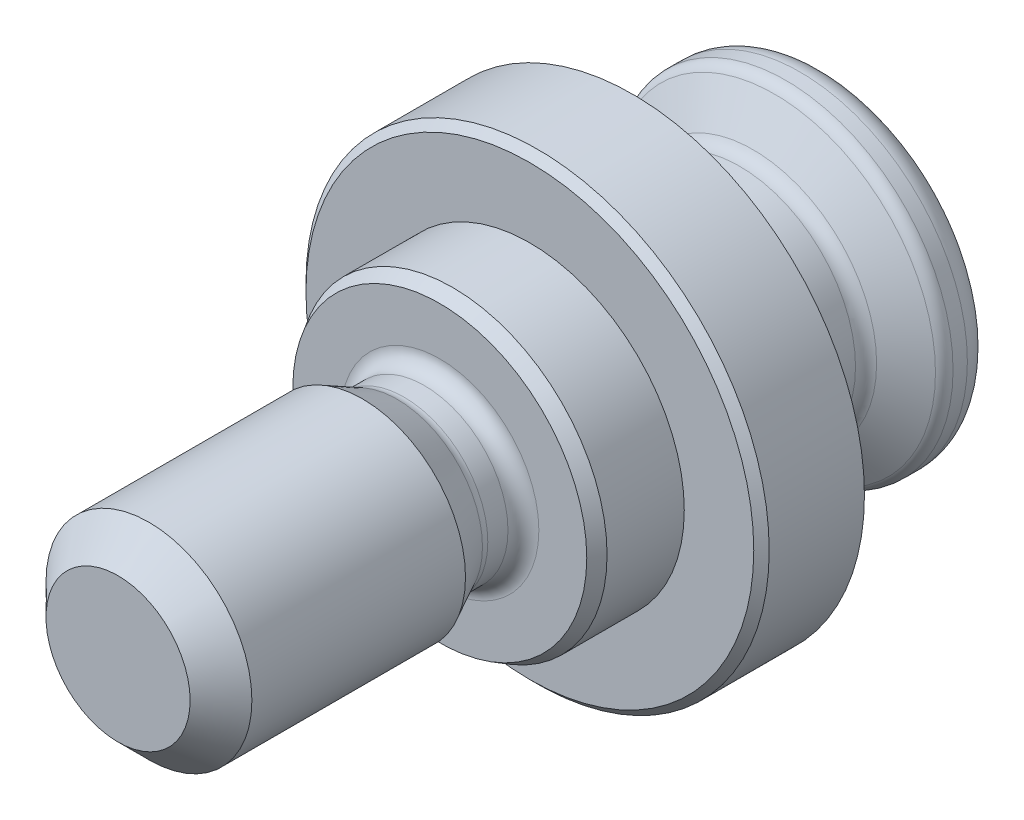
ISO-10303-21;
HEADER;
FILE_DESCRIPTION(('STEP AP214'),'2;1');
FILE_NAME('part.step','',(''),(''),'','','');
FILE_SCHEMA(('AUTOMOTIVE_DESIGN { 1 0 10303 214 1 1 1 1 }'));
ENDSEC;
DATA;
#1=APPLICATION_CONTEXT('core data for automotive mechanical design processes');
#2=APPLICATION_PROTOCOL_DEFINITION('international standard','automotive_design',2000,#1);
#3=PRODUCT_CONTEXT('',#1,'mechanical');
#4=PRODUCT('Part','Part','',(#3));
#5=PRODUCT_RELATED_PRODUCT_CATEGORY('part','',(#4));
#6=PRODUCT_DEFINITION_FORMATION('','',#4);
#7=PRODUCT_DEFINITION_CONTEXT('part definition',#1,'design');
#8=PRODUCT_DEFINITION('design','',#6,#7);
#9=PRODUCT_DEFINITION_SHAPE('','',#8);
#10=(LENGTH_UNIT() NAMED_UNIT(*) SI_UNIT(.MILLI.,.METRE.));
#11=(NAMED_UNIT(*) PLANE_ANGLE_UNIT() SI_UNIT($,.RADIAN.));
#12=(NAMED_UNIT(*) SI_UNIT($,.STERADIAN.) SOLID_ANGLE_UNIT());
#13=UNCERTAINTY_MEASURE_WITH_UNIT(LENGTH_MEASURE(1.E-05),#10,'distance_accuracy_value','');
#14=(GEOMETRIC_REPRESENTATION_CONTEXT(3) GLOBAL_UNCERTAINTY_ASSIGNED_CONTEXT((#13)) GLOBAL_UNIT_ASSIGNED_CONTEXT((#10,
#11,#12)) REPRESENTATION_CONTEXT('',''));
#15=CARTESIAN_POINT('',(0.,0.,0.));
#16=DIRECTION('',(0.,0.,1.));
#17=DIRECTION('',(1.,0.,0.));
#18=AXIS2_PLACEMENT_3D('',#15,#16,#17);
#19=CARTESIAN_POINT('',(0.,0.,-11.5));
#20=DIRECTION('',(0.,0.,1.));
#21=DIRECTION('',(1.,0.,0.));
#22=AXIS2_PLACEMENT_3D('',#19,#20,#21);
#23=PLANE('',#22);
#24=CARTESIAN_POINT('',(0.,0.,-11.5));
#25=DIRECTION('',(0.,0.,1.));
#26=DIRECTION('',(1.,0.,0.));
#27=AXIS2_PLACEMENT_3D('',#24,#25,#26);
#28=CIRCLE('',#27,5.5);
#29=CARTESIAN_POINT('',(5.5,0.,-11.5));
#30=VERTEX_POINT('',#29);
#31=EDGE_CURVE('E9',#30,#30,#28,.F.);
#32=ORIENTED_EDGE('',*,*,#31,.T.);
#33=EDGE_LOOP('',(#32));
#34=FACE_BOUND('',#33,.T.);
#35=CARTESIAN_POINT('',(0.,0.,-11.5));
#36=DIRECTION('',(0.,0.,-1.));
#37=DIRECTION('',(-1.,0.,0.));
#38=AXIS2_PLACEMENT_3D('',#35,#36,#37);
#39=CIRCLE('',#38,2.5);
#40=CARTESIAN_POINT('',(-2.5,0.,-11.5));
#41=VERTEX_POINT('',#40);
#42=EDGE_CURVE('E83',#41,#41,#39,.T.);
#43=ORIENTED_EDGE('',*,*,#42,.F.);
#44=EDGE_LOOP('',(#43));
#45=FACE_BOUND('',#44,.T.);
#46=ADVANCED_FACE('F15',(#34,#45),#23,.F.);
#47=CARTESIAN_POINT('',(0.,0.,0.));
#48=DIRECTION('',(0.,0.,1.));
#49=DIRECTION('',(1.,0.,0.));
#50=AXIS2_PLACEMENT_3D('',#47,#48,#49);
#51=CYLINDRICAL_SURFACE('',#50,6.5);
#52=CARTESIAN_POINT('',(0.,0.,-10.5));
#53=DIRECTION('',(0.,0.,1.));
#54=DIRECTION('',(1.,0.,0.));
#55=AXIS2_PLACEMENT_3D('',#52,#53,#54);
#56=CIRCLE('',#55,6.5);
#57=CARTESIAN_POINT('',(6.5,0.,-10.5));
#58=VERTEX_POINT('',#57);
#59=EDGE_CURVE('E24',#58,#58,#56,.T.);
#60=ORIENTED_EDGE('',*,*,#59,.T.);
#61=EDGE_LOOP('',(#60));
#62=FACE_BOUND('',#61,.T.);
#63=CARTESIAN_POINT('',(0.,0.,-9.94337567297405));
#64=DIRECTION('',(0.,0.,-1.));
#65=DIRECTION('',(-1.,0.,0.));
#66=AXIS2_PLACEMENT_3D('',#63,#64,#65);
#67=CIRCLE('',#66,6.5);
#68=CARTESIAN_POINT('',(-6.5,0.,-9.94337567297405));
#69=VERTEX_POINT('',#68);
#70=EDGE_CURVE('E261',#69,#69,#67,.T.);
#71=ORIENTED_EDGE('',*,*,#70,.T.);
#72=EDGE_LOOP('',(#71));
#73=FACE_BOUND('',#72,.T.);
#74=ADVANCED_FACE('F222',(#62,#73),#51,.T.);
#75=CARTESIAN_POINT('',(0.,0.,-9.65470053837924));
#76=DIRECTION('',(0.,0.,-1.));
#77=DIRECTION('',(-1.,0.,0.));
#78=AXIS2_PLACEMENT_3D('',#75,#76,#77);
#79=CONICAL_SURFACE('',#78,6.5,1.0471975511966);
#80=CARTESIAN_POINT('',(0.,0.,-9.51036297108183));
#81=DIRECTION('',(0.,0.,1.));
#82=DIRECTION('',(1.,0.,0.));
#83=AXIS2_PLACEMENT_3D('',#80,#81,#82);
#84=CIRCLE('',#83,6.25);
#85=CARTESIAN_POINT('',(6.25,0.,-9.51036297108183));
#86=VERTEX_POINT('',#85);
#87=EDGE_CURVE('E266',#86,#86,#84,.T.);
#88=ORIENTED_EDGE('',*,*,#87,.T.);
#89=EDGE_LOOP('',(#88));
#90=FACE_BOUND('',#89,.T.);
#91=CARTESIAN_POINT('',(0.,0.,-8.67320508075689));
#92=DIRECTION('',(0.,0.,-1.));
#93=DIRECTION('',(-1.,0.,0.));
#94=AXIS2_PLACEMENT_3D('',#91,#92,#93);
#95=CIRCLE('',#94,4.8);
#96=CARTESIAN_POINT('',(-4.8,0.,-8.67320508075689));
#97=VERTEX_POINT('',#96);
#98=EDGE_CURVE('E272',#97,#97,#95,.T.);
#99=ORIENTED_EDGE('',*,*,#98,.T.);
#100=EDGE_LOOP('',(#99));
#101=FACE_BOUND('',#100,.T.);
#102=ADVANCED_FACE('F218',(#90,#101),#79,.T.);
#103=CARTESIAN_POINT('',(0.,0.,0.));
#104=DIRECTION('',(0.,0.,1.));
#105=DIRECTION('',(1.,0.,0.));
#106=AXIS2_PLACEMENT_3D('',#103,#104,#105);
#107=CYLINDRICAL_SURFACE('',#106,4.5);
#108=CARTESIAN_POINT('',(0.,0.,-6.94448637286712));
#109=DIRECTION('',(0.,0.,1.));
#110=DIRECTION('',(1.,0.,0.));
#111=AXIS2_PLACEMENT_3D('',#108,#109,#110);
#112=CIRCLE('',#111,4.5);
#113=CARTESIAN_POINT('',(4.5,0.,-6.94448637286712));
#114=VERTEX_POINT('',#113);
#115=EDGE_CURVE('E276',#114,#114,#112,.F.);
#116=ORIENTED_EDGE('',*,*,#115,.T.);
#117=EDGE_LOOP('',(#116));
#118=FACE_BOUND('',#117,.T.);
#119=CARTESIAN_POINT('',(0.,0.,-8.15358983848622));
#120=DIRECTION('',(0.,0.,1.));
#121=DIRECTION('',(1.,0.,0.));
#122=AXIS2_PLACEMENT_3D('',#119,#120,#121);
#123=CIRCLE('',#122,4.5);
#124=CARTESIAN_POINT('',(4.5,0.,-8.15358983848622));
#125=VERTEX_POINT('',#124);
#126=EDGE_CURVE('E280',#125,#125,#123,.T.);
#127=ORIENTED_EDGE('',*,*,#126,.T.);
#128=EDGE_LOOP('',(#127));
#129=FACE_BOUND('',#128,.T.);
#130=ADVANCED_FACE('F214',(#118,#129),#107,.T.);
#131=CARTESIAN_POINT('',(0.,0.,-6.59807621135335));
#132=DIRECTION('',(0.,0.,1.));
#133=DIRECTION('',(1.,0.,0.));
#134=AXIS2_PLACEMENT_3D('',#131,#132,#133);
#135=CONICAL_SURFACE('',#134,4.5,1.0471975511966);
#136=CARTESIAN_POINT('',(0.,0.,-6.42487113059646));
#137=DIRECTION('',(0.,0.,1.));
#138=DIRECTION('',(1.,0.,0.));
#139=AXIS2_PLACEMENT_3D('',#136,#137,#138);
#140=CIRCLE('',#139,4.8);
#141=CARTESIAN_POINT('',(4.8,0.,-6.42487113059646));
#142=VERTEX_POINT('',#141);
#143=EDGE_CURVE('E284',#142,#142,#140,.T.);
#144=ORIENTED_EDGE('',*,*,#143,.T.);
#145=EDGE_LOOP('',(#144));
#146=FACE_BOUND('',#145,.T.);
#147=CARTESIAN_POINT('',(0.,0.,-4.));
#148=DIRECTION('',(0.,0.,1.));
#149=DIRECTION('',(1.,0.,0.));
#150=AXIS2_PLACEMENT_3D('',#147,#148,#149);
#151=CIRCLE('',#150,9.);
#152=CARTESIAN_POINT('',(9.,0.,-4.));
#153=VERTEX_POINT('',#152);
#154=EDGE_CURVE('E304',#153,#153,#151,.T.);
#155=ORIENTED_EDGE('',*,*,#154,.F.);
#156=EDGE_LOOP('',(#155));
#157=FACE_BOUND('',#156,.T.);
#158=ADVANCED_FACE('F210',(#146,#157),#135,.T.);
#159=CARTESIAN_POINT('',(0.,0.,0.));
#160=DIRECTION('',(0.,0.,1.));
#161=DIRECTION('',(1.,0.,0.));
#162=AXIS2_PLACEMENT_3D('',#159,#160,#161);
#163=CYLINDRICAL_SURFACE('',#162,9.);
#164=CARTESIAN_POINT('',(0.,0.,-0.300000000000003));
#165=DIRECTION('',(0.,0.,-1.));
#166=DIRECTION('',(-1.,0.,0.));
#167=AXIS2_PLACEMENT_3D('',#164,#165,#166);
#168=CIRCLE('',#167,9.);
#169=CARTESIAN_POINT('',(-9.,0.,-0.300000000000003));
#170=VERTEX_POINT('',#169);
#171=EDGE_CURVE('E296',#170,#170,#168,.T.);
#172=ORIENTED_EDGE('',*,*,#171,.T.);
#173=EDGE_LOOP('',(#172));
#174=FACE_BOUND('',#173,.T.);
#175=ORIENTED_EDGE('',*,*,#154,.T.);
#176=EDGE_LOOP('',(#175));
#177=FACE_BOUND('',#176,.T.);
#178=ADVANCED_FACE('F206',(#174,#177),#163,.T.);
#179=CARTESIAN_POINT('',(-9.,0.,0.));
#180=DIRECTION('',(0.,0.,-1.));
#181=DIRECTION('',(-1.,0.,0.));
#182=AXIS2_PLACEMENT_3D('',#179,#180,#181);
#183=PLANE('',#182);
#184=CARTESIAN_POINT('',(0.,0.,0.));
#185=DIRECTION('',(0.,0.,-1.));
#186=DIRECTION('',(-1.,0.,0.));
#187=AXIS2_PLACEMENT_3D('',#184,#185,#186);
#188=CIRCLE('',#187,8.7);
#189=CARTESIAN_POINT('',(-8.7,0.,0.));
#190=VERTEX_POINT('',#189);
#191=EDGE_CURVE('E300',#190,#190,#188,.F.);
#192=ORIENTED_EDGE('',*,*,#191,.T.);
#193=EDGE_LOOP('',(#192));
#194=FACE_BOUND('',#193,.T.);
#195=CARTESIAN_POINT('',(0.,0.,0.));
#196=DIRECTION('',(0.,0.,1.));
#197=DIRECTION('',(1.,0.,0.));
#198=AXIS2_PLACEMENT_3D('',#195,#196,#197);
#199=CIRCLE('',#198,6.);
#200=CARTESIAN_POINT('',(6.,0.,0.));
#201=VERTEX_POINT('',#200);
#202=EDGE_CURVE('E308',#201,#201,#199,.T.);
#203=ORIENTED_EDGE('',*,*,#202,.F.);
#204=EDGE_LOOP('',(#203));
#205=FACE_BOUND('',#204,.T.);
#206=ADVANCED_FACE('F202',(#194,#205),#183,.F.);
#207=CARTESIAN_POINT('',(0.,0.,0.));
#208=DIRECTION('',(0.,0.,1.));
#209=DIRECTION('',(1.,0.,0.));
#210=AXIS2_PLACEMENT_3D('',#207,#208,#209);
#211=CYLINDRICAL_SURFACE('',#210,6.);
#212=CARTESIAN_POINT('',(0.,0.,3.));
#213=DIRECTION('',(0.,0.,-1.));
#214=DIRECTION('',(-1.,0.,0.));
#215=AXIS2_PLACEMENT_3D('',#212,#213,#214);
#216=CIRCLE('',#215,6.);
#217=CARTESIAN_POINT('',(-6.,0.,3.));
#218=VERTEX_POINT('',#217);
#219=EDGE_CURVE('E256',#218,#218,#216,.T.);
#220=ORIENTED_EDGE('',*,*,#219,.T.);
#221=EDGE_LOOP('',(#220));
#222=FACE_BOUND('',#221,.T.);
#223=ORIENTED_EDGE('',*,*,#202,.T.);
#224=EDGE_LOOP('',(#223));
#225=FACE_BOUND('',#224,.T.);
#226=ADVANCED_FACE('F198',(#222,#225),#211,.T.);
#227=CARTESIAN_POINT('',(-6.,0.,3.5));
#228=DIRECTION('',(0.,0.,-1.));
#229=DIRECTION('',(-1.,0.,0.));
#230=AXIS2_PLACEMENT_3D('',#227,#228,#229);
#231=PLANE('',#230);
#232=CARTESIAN_POINT('',(0.,0.,3.5));
#233=DIRECTION('',(0.,0.,-1.));
#234=DIRECTION('',(-1.,0.,0.));
#235=AXIS2_PLACEMENT_3D('',#232,#233,#234);
#236=CIRCLE('',#235,5.71132486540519);
#237=CARTESIAN_POINT('',(-5.71132486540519,0.,3.5));
#238=VERTEX_POINT('',#237);
#239=EDGE_CURVE('E259',#238,#238,#236,.F.);
#240=ORIENTED_EDGE('',*,*,#239,.T.);
#241=EDGE_LOOP('',(#240));
#242=FACE_BOUND('',#241,.T.);
#243=CARTESIAN_POINT('',(0.,0.,3.5));
#244=DIRECTION('',(0.,0.,1.));
#245=DIRECTION('',(1.,0.,0.));
#246=AXIS2_PLACEMENT_3D('',#243,#244,#245);
#247=CIRCLE('',#246,3.85);
#248=CARTESIAN_POINT('',(3.85,0.,3.5));
#249=VERTEX_POINT('',#248);
#250=EDGE_CURVE('E328',#249,#249,#247,.T.);
#251=ORIENTED_EDGE('',*,*,#250,.F.);
#252=EDGE_LOOP('',(#251));
#253=FACE_BOUND('',#252,.T.);
#254=ADVANCED_FACE('F186',(#242,#253),#231,.F.);
#255=CARTESIAN_POINT('',(0.,0.,6.5));
#256=DIRECTION('',(0.,0.,1.));
#257=DIRECTION('',(1.,0.,0.));
#258=AXIS2_PLACEMENT_3D('',#255,#256,#257);
#259=CONICAL_SURFACE('',#258,4.,0.471238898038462);
#260=CARTESIAN_POINT('',(0.,0.,5.15638916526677));
#261=DIRECTION('',(0.,0.,1.));
#262=DIRECTION('',(1.,0.,0.));
#263=AXIS2_PLACEMENT_3D('',#260,#261,#262);
#264=CIRCLE('',#263,3.31539608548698);
#265=CARTESIAN_POINT('',(3.31539608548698,0.,5.15638916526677));
#266=VERTEX_POINT('',#265);
#267=EDGE_CURVE('E316',#266,#266,#264,.T.);
#268=ORIENTED_EDGE('',*,*,#267,.T.);
#269=EDGE_LOOP('',(#268));
#270=FACE_BOUND('',#269,.T.);
#271=CARTESIAN_POINT('',(0.,0.,6.5));
#272=DIRECTION('',(0.,0.,1.));
#273=DIRECTION('',(1.,0.,0.));
#274=AXIS2_PLACEMENT_3D('',#271,#272,#273);
#275=CIRCLE('',#274,4.);
#276=CARTESIAN_POINT('',(4.,0.,6.5));
#277=VERTEX_POINT('',#276);
#278=EDGE_CURVE('E312',#277,#277,#275,.T.);
#279=ORIENTED_EDGE('',*,*,#278,.F.);
#280=EDGE_LOOP('',(#279));
#281=FACE_BOUND('',#280,.T.);
#282=ADVANCED_FACE('F182',(#270,#281),#259,.T.);
#283=CARTESIAN_POINT('',(0.,0.,4.88399486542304));
#284=DIRECTION('',(0.,0.,1.));
#285=DIRECTION('',(1.,0.,0.));
#286=AXIS2_PLACEMENT_3D('',#283,#284,#285);
#287=TOROIDAL_SURFACE('',#286,3.85,0.6);
#288=CARTESIAN_POINT('',(0.,0.,4.88399486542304));
#289=DIRECTION('',(0.,0.,1.));
#290=DIRECTION('',(1.,0.,0.));
#291=AXIS2_PLACEMENT_3D('',#288,#289,#290);
#292=CIRCLE('',#291,3.25);
#293=CARTESIAN_POINT('',(3.25,0.,4.88399486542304));
#294=VERTEX_POINT('',#293);
#295=EDGE_CURVE('E320',#294,#294,#292,.T.);
#296=ORIENTED_EDGE('',*,*,#295,.T.);
#297=EDGE_LOOP('',(#296));
#298=FACE_BOUND('',#297,.T.);
#299=ORIENTED_EDGE('',*,*,#267,.F.);
#300=EDGE_LOOP('',(#299));
#301=FACE_BOUND('',#300,.T.);
#302=ADVANCED_FACE('F178',(#298,#301),#287,.F.);
#303=CARTESIAN_POINT('',(0.,0.,0.));
#304=DIRECTION('',(0.,0.,1.));
#305=DIRECTION('',(1.,0.,0.));
#306=AXIS2_PLACEMENT_3D('',#303,#304,#305);
#307=CYLINDRICAL_SURFACE('',#306,3.25);
#308=CARTESIAN_POINT('',(0.,0.,4.1));
#309=DIRECTION('',(0.,0.,1.));
#310=DIRECTION('',(1.,0.,0.));
#311=AXIS2_PLACEMENT_3D('',#308,#309,#310);
#312=CIRCLE('',#311,3.25);
#313=CARTESIAN_POINT('',(3.25,0.,4.1));
#314=VERTEX_POINT('',#313);
#315=EDGE_CURVE('E324',#314,#314,#312,.T.);
#316=ORIENTED_EDGE('',*,*,#315,.T.);
#317=EDGE_LOOP('',(#316));
#318=FACE_BOUND('',#317,.T.);
#319=ORIENTED_EDGE('',*,*,#295,.F.);
#320=EDGE_LOOP('',(#319));
#321=FACE_BOUND('',#320,.T.);
#322=ADVANCED_FACE('F174',(#318,#321),#307,.T.);
#323=CARTESIAN_POINT('',(0.,0.,4.1));
#324=DIRECTION('',(0.,0.,1.));
#325=DIRECTION('',(1.,0.,0.));
#326=AXIS2_PLACEMENT_3D('',#323,#324,#325);
#327=TOROIDAL_SURFACE('',#326,3.85,0.6);
#328=ORIENTED_EDGE('',*,*,#250,.T.);
#329=EDGE_LOOP('',(#328));
#330=FACE_BOUND('',#329,.T.);
#331=ORIENTED_EDGE('',*,*,#315,.F.);
#332=EDGE_LOOP('',(#331));
#333=FACE_BOUND('',#332,.T.);
#334=ADVANCED_FACE('F170',(#330,#333),#327,.F.);
#335=CARTESIAN_POINT('',(0.,0.,16.));
#336=DIRECTION('',(0.,0.,1.));
#337=DIRECTION('',(1.,0.,0.));
#338=AXIS2_PLACEMENT_3D('',#335,#336,#337);
#339=PLANE('',#338);
#340=CARTESIAN_POINT('',(0.,0.,16.));
#341=DIRECTION('',(0.,0.,1.));
#342=DIRECTION('',(1.,0.,0.));
#343=AXIS2_PLACEMENT_3D('',#340,#341,#342);
#344=CIRCLE('',#343,2.8);
#345=CARTESIAN_POINT('',(2.8,0.,16.));
#346=VERTEX_POINT('',#345);
#347=EDGE_CURVE('E292',#346,#346,#344,.T.);
#348=ORIENTED_EDGE('',*,*,#347,.T.);
#349=EDGE_LOOP('',(#348));
#350=FACE_BOUND('',#349,.T.);
#351=ADVANCED_FACE('F173',(#350),#339,.T.);
#352=CARTESIAN_POINT('',(0.,0.,16.));
#353=DIRECTION('',(0.,0.,-1.));
#354=DIRECTION('',(-1.,0.,0.));
#355=AXIS2_PLACEMENT_3D('',#352,#353,#354);
#356=CYLINDRICAL_SURFACE('',#355,4.);
#357=CARTESIAN_POINT('',(0.,0.,14.8));
#358=DIRECTION('',(0.,0.,1.));
#359=DIRECTION('',(1.,0.,0.));
#360=AXIS2_PLACEMENT_3D('',#357,#358,#359);
#361=CIRCLE('',#360,4.);
#362=CARTESIAN_POINT('',(4.,0.,14.8));
#363=VERTEX_POINT('',#362);
#364=EDGE_CURVE('E288',#363,#363,#361,.F.);
#365=ORIENTED_EDGE('',*,*,#364,.T.);
#366=EDGE_LOOP('',(#365));
#367=FACE_BOUND('',#366,.T.);
#368=ORIENTED_EDGE('',*,*,#278,.T.);
#369=EDGE_LOOP('',(#368));
#370=FACE_BOUND('',#369,.T.);
#371=ADVANCED_FACE('F190',(#367,#370),#356,.T.);
#372=CARTESIAN_POINT('',(0.,0.,0.));
#373=DIRECTION('',(0.,0.,-1.));
#374=DIRECTION('',(-1.,0.,0.));
#375=AXIS2_PLACEMENT_3D('',#372,#373,#374);
#376=CONICAL_SURFACE('',#375,8.7,0.785398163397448);
#377=ORIENTED_EDGE('',*,*,#171,.F.);
#378=EDGE_LOOP('',(#377));
#379=FACE_BOUND('',#378,.T.);
#380=ORIENTED_EDGE('',*,*,#191,.F.);
#381=EDGE_LOOP('',(#380));
#382=FACE_BOUND('',#381,.T.);
#383=ADVANCED_FACE('F194',(#379,#382),#376,.T.);
#384=CARTESIAN_POINT('',(0.,0.,16.));
#385=DIRECTION('',(0.,0.,-1.));
#386=DIRECTION('',(-1.,0.,0.));
#387=AXIS2_PLACEMENT_3D('',#384,#385,#386);
#388=CONICAL_SURFACE('',#387,2.8,0.785398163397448);
#389=ORIENTED_EDGE('',*,*,#364,.F.);
#390=EDGE_LOOP('',(#389));
#391=FACE_BOUND('',#390,.T.);
#392=ORIENTED_EDGE('',*,*,#347,.F.);
#393=EDGE_LOOP('',(#392));
#394=FACE_BOUND('',#393,.T.);
#395=ADVANCED_FACE('F232',(#391,#394),#388,.T.);
#396=CARTESIAN_POINT('',(0.,0.,-6.94448637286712));
#397=DIRECTION('',(0.,0.,1.));
#398=DIRECTION('',(1.,0.,0.));
#399=AXIS2_PLACEMENT_3D('',#396,#397,#398);
#400=TOROIDAL_SURFACE('',#399,5.1,0.6);
#401=ORIENTED_EDGE('',*,*,#115,.F.);
#402=EDGE_LOOP('',(#401));
#403=FACE_BOUND('',#402,.T.);
#404=ORIENTED_EDGE('',*,*,#143,.F.);
#405=EDGE_LOOP('',(#404));
#406=FACE_BOUND('',#405,.T.);
#407=ADVANCED_FACE('F236',(#403,#406),#400,.F.);
#408=CARTESIAN_POINT('',(0.,0.,-8.15358983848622));
#409=DIRECTION('',(0.,0.,1.));
#410=DIRECTION('',(1.,0.,0.));
#411=AXIS2_PLACEMENT_3D('',#408,#409,#410);
#412=TOROIDAL_SURFACE('',#411,5.1,0.6);
#413=ORIENTED_EDGE('',*,*,#98,.F.);
#414=EDGE_LOOP('',(#413));
#415=FACE_BOUND('',#414,.T.);
#416=ORIENTED_EDGE('',*,*,#126,.F.);
#417=EDGE_LOOP('',(#416));
#418=FACE_BOUND('',#417,.T.);
#419=ADVANCED_FACE('F240',(#415,#418),#412,.F.);
#420=CARTESIAN_POINT('',(0.,0.,-9.94337567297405));
#421=DIRECTION('',(0.,0.,-1.));
#422=DIRECTION('',(-1.,0.,0.));
#423=AXIS2_PLACEMENT_3D('',#420,#421,#422);
#424=TOROIDAL_SURFACE('',#423,6.,0.5);
#425=ORIENTED_EDGE('',*,*,#70,.F.);
#426=EDGE_LOOP('',(#425));
#427=FACE_BOUND('',#426,.T.);
#428=ORIENTED_EDGE('',*,*,#87,.F.);
#429=EDGE_LOOP('',(#428));
#430=FACE_BOUND('',#429,.T.);
#431=ADVANCED_FACE('F244',(#427,#430),#424,.T.);
#432=CARTESIAN_POINT('',(0.,0.,3.5));
#433=DIRECTION('',(0.,0.,-1.));
#434=DIRECTION('',(-1.,0.,0.));
#435=AXIS2_PLACEMENT_3D('',#432,#433,#434);
#436=CONICAL_SURFACE('',#435,5.71132486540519,0.523598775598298);
#437=ORIENTED_EDGE('',*,*,#219,.F.);
#438=EDGE_LOOP('',(#437));
#439=FACE_BOUND('',#438,.T.);
#440=ORIENTED_EDGE('',*,*,#239,.F.);
#441=EDGE_LOOP('',(#440));
#442=FACE_BOUND('',#441,.T.);
#443=ADVANCED_FACE('F116',(#439,#442),#436,.T.);
#444=CARTESIAN_POINT('',(0.,0.,-11.5));
#445=DIRECTION('',(0.,0.,-1.));
#446=DIRECTION('',(-1.,0.,0.));
#447=AXIS2_PLACEMENT_3D('',#444,#445,#446);
#448=CONICAL_SURFACE('',#447,2.5,0.785398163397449);
#449=ORIENTED_EDGE('',*,*,#42,.T.);
#450=EDGE_LOOP('',(#449));
#451=FACE_BOUND('',#450,.T.);
#452=CARTESIAN_POINT('',(2.30951654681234,0.0002,-11.3095165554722));
#453=CARTESIAN_POINT('',(2.26982196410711,-0.068553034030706,-11.2698541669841));
#454=CARTESIAN_POINT('',(2.22946361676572,-0.138455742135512,-11.2325210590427));
#455=CARTESIAN_POINT('',(2.14716839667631,-0.280995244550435,-11.1641647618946));
#456=CARTESIAN_POINT('',(2.10522369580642,-0.353645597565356,-11.1331796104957));
#457=CARTESIAN_POINT('',(2.02064418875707,-0.500141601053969,-11.0801012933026));
#458=CARTESIAN_POINT('',(1.97803092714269,-0.573949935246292,-11.0578747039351));
#459=CARTESIAN_POINT('',(1.89186619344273,-0.723191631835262,-11.0236298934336));
#460=CARTESIAN_POINT('',(1.84831735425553,-0.79862043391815,-11.0115861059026));
#461=CARTESIAN_POINT('',(1.7732646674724,-0.928615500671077,-11.0007195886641));
#462=CARTESIAN_POINT('',(1.74185780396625,-0.983013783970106,-10.9991108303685));
#463=CARTESIAN_POINT('',(1.67909540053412,-1.09172145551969,-11.0018199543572));
#464=CARTESIAN_POINT('',(1.64773988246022,-1.14603080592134,-11.0061399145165));
#465=CARTESIAN_POINT('',(1.58532489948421,-1.25413672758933,-11.0204606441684));
#466=CARTESIAN_POINT('',(1.5542658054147,-1.30793265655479,-11.0304677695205));
#467=CARTESIAN_POINT('',(1.49268469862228,-1.41459426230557,-11.0556135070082));
#468=CARTESIAN_POINT('',(1.46216264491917,-1.46746001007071,-11.0707517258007));
#469=CARTESIAN_POINT('',(1.38397803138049,-1.60287973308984,-11.1156955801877));
#470=CARTESIAN_POINT('',(1.33680037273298,-1.68459383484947,-11.1488899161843));
#471=CARTESIAN_POINT('',(1.26742988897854,-1.8047470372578,-11.2049268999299));
#472=CARTESIAN_POINT('',(1.24456923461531,-1.84434285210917,-11.2246157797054));
#473=CARTESIAN_POINT('',(1.19927142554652,-1.92280095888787,-11.2657883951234));
#474=CARTESIAN_POINT('',(1.17683402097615,-1.96166368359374,-11.2872710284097));
#475=CARTESIAN_POINT('',(1.15458506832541,-2.0002,-11.3095165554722));
#476=B_SPLINE_CURVE_WITH_KNOTS('',3,(#452,#453,#454,#455,#456,#457,#458,#459,#460,#461,#462,
#463,#464,#465,#466,#467,#468,#469,#470,#471,#472,#473,#474,#475),.UNSPECIFIED.,.F.,.F.,(4,2,2,
2,2,2,2,2,2,2,2,4),(0.,0.266420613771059,0.534393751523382,0.798110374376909,1.06116288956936,
1.24939906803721,1.43770123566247,1.62621426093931,1.81471283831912,2.11415604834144,
2.2634717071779,2.41269626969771),.UNSPECIFIED.);
#477=CARTESIAN_POINT('',(2.30940107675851,0.,-11.3094010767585));
#478=VERTEX_POINT('',#477);
#479=CARTESIAN_POINT('',(1.15470053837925,-2.,-11.3094010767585));
#480=VERTEX_POINT('',#479);
#481=EDGE_CURVE('E132',#478,#480,#476,.T.);
#482=ORIENTED_EDGE('',*,*,#481,.F.);
#483=CARTESIAN_POINT('',(1.15458506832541,2.0002,-11.3095165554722));
#484=CARTESIAN_POINT('',(1.19427965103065,1.93144696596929,-11.2698541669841));
#485=CARTESIAN_POINT('',(1.23463799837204,1.86154425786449,-11.2325210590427));
#486=CARTESIAN_POINT('',(1.31693321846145,1.71900475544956,-11.1641647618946));
#487=CARTESIAN_POINT('',(1.35887791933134,1.64635440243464,-11.1331796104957));
#488=CARTESIAN_POINT('',(1.44345742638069,1.49985839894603,-11.0801012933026));
#489=CARTESIAN_POINT('',(1.48607068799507,1.4260500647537,-11.0578747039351));
#490=CARTESIAN_POINT('',(1.57223542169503,1.27680836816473,-11.0236298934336));
#491=CARTESIAN_POINT('',(1.61578426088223,1.20137956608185,-11.0115861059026));
#492=CARTESIAN_POINT('',(1.69083694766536,1.07138449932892,-11.0007195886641));
#493=CARTESIAN_POINT('',(1.72224381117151,1.01698621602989,-10.9991108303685));
#494=CARTESIAN_POINT('',(1.78500621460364,0.908278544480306,-11.0018199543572));
#495=CARTESIAN_POINT('',(1.81636173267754,0.85396919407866,-11.0061399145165));
#496=CARTESIAN_POINT('',(1.87877671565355,0.745863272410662,-11.0204606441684));
#497=CARTESIAN_POINT('',(1.90983580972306,0.692067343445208,-11.0304677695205));
#498=CARTESIAN_POINT('',(1.97141691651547,0.585405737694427,-11.0556135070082));
#499=CARTESIAN_POINT('',(2.00193897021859,0.532539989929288,-11.0707517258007));
#500=CARTESIAN_POINT('',(2.08012358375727,0.397120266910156,-11.1156955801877));
#501=CARTESIAN_POINT('',(2.12730124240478,0.315406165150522,-11.1488899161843));
#502=CARTESIAN_POINT('',(2.19667172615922,0.195252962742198,-11.2049268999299));
#503=CARTESIAN_POINT('',(2.21953238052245,0.155657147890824,-11.2246157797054));
#504=CARTESIAN_POINT('',(2.26483018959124,0.0771990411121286,-11.2657883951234));
#505=CARTESIAN_POINT('',(2.28726759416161,0.0383363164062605,-11.2872710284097));
#506=CARTESIAN_POINT('',(2.30951654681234,-0.000199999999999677,-11.3095165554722));
#507=B_SPLINE_CURVE_WITH_KNOTS('',3,(#483,#484,#485,#486,#487,#488,#489,#490,#491,#492,#493,
#494,#495,#496,#497,#498,#499,#500,#501,#502,#503,#504,#505,#506),.UNSPECIFIED.,.F.,.F.,(4,2,2,
2,2,2,2,2,2,2,2,4),(0.,0.266420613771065,0.534393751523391,0.798110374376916,1.06116288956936,
1.24939906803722,1.43770123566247,1.62621426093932,1.81471283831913,2.11415604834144,
2.2634717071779,2.4126962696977),.UNSPECIFIED.);
#508=CARTESIAN_POINT('',(1.15470053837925,2.,-11.3094010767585));
#509=VERTEX_POINT('',#508);
#510=EDGE_CURVE('E31',#509,#478,#507,.T.);
#511=ORIENTED_EDGE('',*,*,#510,.F.);
#512=CARTESIAN_POINT('',(-2.44649663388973,2.,-12.1599597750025));
#513=CARTESIAN_POINT('',(-2.38752924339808,2.,-12.1143163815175));
#514=CARTESIAN_POINT('',(-2.32824833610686,2.,-12.0690717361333));
#515=CARTESIAN_POINT('',(-2.20892986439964,2.,-11.9795633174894));
#516=CARTESIAN_POINT('',(-2.14889212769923,2.,-11.9352997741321));
#517=CARTESIAN_POINT('',(-2.02749215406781,2.,-11.8476221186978));
#518=CARTESIAN_POINT('',(-1.96612327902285,2.,-11.8042171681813));
#519=CARTESIAN_POINT('',(-1.84237153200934,2.,-11.7188827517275));
#520=CARTESIAN_POINT('',(-1.77998872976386,2.,-11.6769531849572));
#521=CARTESIAN_POINT('',(-1.64989501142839,2.,-11.5922111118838));
#522=CARTESIAN_POINT('',(-1.58210344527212,2.,-11.5495217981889));
#523=CARTESIAN_POINT('',(-1.44494653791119,2.,-11.4667548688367));
#524=CARTESIAN_POINT('',(-1.37558140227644,2.,-11.4266769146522));
#525=CARTESIAN_POINT('',(-1.23521967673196,2.,-11.3499623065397));
#526=CARTESIAN_POINT('',(-1.1642283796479,2.,-11.3133160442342));
#527=CARTESIAN_POINT('',(-1.02021617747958,2.,-11.2442927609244));
#528=CARTESIAN_POINT('',(-0.947196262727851,2.,-11.2119136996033));
#529=CARTESIAN_POINT('',(-0.806692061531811,2.,-11.1557027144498));
#530=CARTESIAN_POINT('',(-0.7394257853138,2.,-11.1313313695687));
#531=CARTESIAN_POINT('',(-0.603148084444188,2.,-11.0879700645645));
#532=CARTESIAN_POINT('',(-0.53413655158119,2.,-11.0689804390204));
#533=CARTESIAN_POINT('',(-0.396001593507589,2.,-11.0377402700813));
#534=CARTESIAN_POINT('',(-0.326906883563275,2.,-11.025364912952));
#535=CARTESIAN_POINT('',(-0.187818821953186,2.,-11.0076169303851));
#536=CARTESIAN_POINT('',(-0.117825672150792,2.,-11.0022427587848));
#537=CARTESIAN_POINT('',(0.0190807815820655,2.,-10.9989745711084));
#538=CARTESIAN_POINT('',(0.0859861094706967,2.,-11.0007446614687));
#539=CARTESIAN_POINT('',(0.219290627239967,2.,-11.010887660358));
#540=CARTESIAN_POINT('',(0.285689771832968,2.,-11.0192611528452));
#541=CARTESIAN_POINT('',(0.4186294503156,2.,-11.0422735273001));
#542=CARTESIAN_POINT('',(0.485150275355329,2.,-11.0570244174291));
#543=CARTESIAN_POINT('',(0.616716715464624,2.,-11.0919647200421));
#544=CARTESIAN_POINT('',(0.681762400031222,2.,-11.1121538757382));
#545=CARTESIAN_POINT('',(0.880509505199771,2.,-11.1815999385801));
#546=CARTESIAN_POINT('',(1.01152822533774,2.,-11.2385055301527));
#547=CARTESIAN_POINT('',(1.26746497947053,2.,-11.365167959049));
#548=CARTESIAN_POINT('',(1.39235964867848,2.,-11.434969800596));
#549=CARTESIAN_POINT('',(1.57290838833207,2.,-11.5439979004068));
#550=CARTESIAN_POINT('',(1.63051520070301,2.,-11.5800548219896));
#551=CARTESIAN_POINT('',(1.74473948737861,2.,-11.6537147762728));
#552=CARTESIAN_POINT('',(1.80135688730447,2.,-11.6913179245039));
#553=CARTESIAN_POINT('',(1.91327715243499,2.,-11.7674828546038));
#554=CARTESIAN_POINT('',(1.96858691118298,2.,-11.8060345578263));
#555=CARTESIAN_POINT('',(2.07844696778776,2.,-11.8841748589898));
#556=CARTESIAN_POINT('',(2.13299747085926,2.,-11.9237631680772));
#557=CARTESIAN_POINT('',(2.18722940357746,2.,-11.963776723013));
#558=B_SPLINE_CURVE_WITH_KNOTS('',3,(#512,#513,#514,#515,#516,#517,#518,#519,#520,#521,#522,
#523,#524,#525,#526,#527,#528,#529,#530,#531,#532,#533,#534,#535,#536,#537,#538,#539,#540,#541,
#542,#543,#544,#545,#546,#547,#548,#549,#550,#551,#552,#553,#554,#555,#556,#557),.UNSPECIFIED.,
.F.,.F.,(4,2,2,2,2,2,2,2,2,2,2,2,2,2,2,2,2,2,2,2,2,2,4),(0.,0.223709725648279,0.447471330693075,
0.672955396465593,0.898424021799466,1.13871632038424,1.37897740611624,1.61854430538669,
1.85799623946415,2.07244792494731,2.28691293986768,2.49717362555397,2.70738786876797,
2.90783658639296,3.10830303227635,3.31244325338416,3.51657383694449,3.94386538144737,
4.37267722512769,4.57653979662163,4.78041762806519,4.9826640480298,5.18485469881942),.UNSPECIFIED.);
#559=CARTESIAN_POINT('',(-1.15470053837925,2.,-11.3094010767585));
#560=VERTEX_POINT('',#559);
#561=EDGE_CURVE('E121',#560,#509,#558,.T.);
#562=ORIENTED_EDGE('',*,*,#561,.F.);
#563=CARTESIAN_POINT('',(-2.30951654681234,-0.0002,-11.3095165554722));
#564=CARTESIAN_POINT('',(-2.26982196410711,0.068553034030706,-11.2698541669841));
#565=CARTESIAN_POINT('',(-2.22946361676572,0.138455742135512,-11.2325210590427));
#566=CARTESIAN_POINT('',(-2.14716839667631,0.280995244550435,-11.1641647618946));
#567=CARTESIAN_POINT('',(-2.10522369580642,0.353645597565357,-11.1331796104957));
#568=CARTESIAN_POINT('',(-2.02064418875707,0.500141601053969,-11.0801012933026));
#569=CARTESIAN_POINT('',(-1.97803092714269,0.573949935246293,-11.0578747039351));
#570=CARTESIAN_POINT('',(-1.89186619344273,0.723191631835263,-11.0236298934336));
#571=CARTESIAN_POINT('',(-1.84831735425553,0.79862043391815,-11.0115861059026));
#572=CARTESIAN_POINT('',(-1.7732646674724,0.928615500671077,-11.0007195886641));
#573=CARTESIAN_POINT('',(-1.74185780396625,0.983013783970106,-10.9991108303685));
#574=CARTESIAN_POINT('',(-1.67909540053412,1.09172145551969,-11.0018199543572));
#575=CARTESIAN_POINT('',(-1.64773988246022,1.14603080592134,-11.0061399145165));
#576=CARTESIAN_POINT('',(-1.58532489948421,1.25413672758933,-11.0204606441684));
#577=CARTESIAN_POINT('',(-1.5542658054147,1.30793265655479,-11.0304677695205));
#578=CARTESIAN_POINT('',(-1.49268469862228,1.41459426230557,-11.0556135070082));
#579=CARTESIAN_POINT('',(-1.46216264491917,1.46746001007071,-11.0707517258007));
#580=CARTESIAN_POINT('',(-1.38397803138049,1.60287973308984,-11.1156955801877));
#581=CARTESIAN_POINT('',(-1.33680037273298,1.68459383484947,-11.1488899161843));
#582=CARTESIAN_POINT('',(-1.26742988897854,1.8047470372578,-11.2049268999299));
#583=CARTESIAN_POINT('',(-1.24456923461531,1.84434285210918,-11.2246157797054));
#584=CARTESIAN_POINT('',(-1.19927142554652,1.92280095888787,-11.2657883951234));
#585=CARTESIAN_POINT('',(-1.17683402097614,1.96166368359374,-11.2872710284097));
#586=CARTESIAN_POINT('',(-1.15458506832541,2.0002,-11.3095165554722));
#587=B_SPLINE_CURVE_WITH_KNOTS('',3,(#563,#564,#565,#566,#567,#568,#569,#570,#571,#572,#573,
#574,#575,#576,#577,#578,#579,#580,#581,#582,#583,#584,#585,#586),.UNSPECIFIED.,.F.,.F.,(4,2,2,
2,2,2,2,2,2,2,2,4),(0.,0.266420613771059,0.534393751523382,0.798110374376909,1.06116288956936,
1.24939906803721,1.43770123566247,1.62621426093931,1.81471283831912,2.11415604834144,
2.2634717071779,2.41269626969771),.UNSPECIFIED.);
#588=CARTESIAN_POINT('',(-2.30940107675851,0.,-11.3094010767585));
#589=VERTEX_POINT('',#588);
#590=EDGE_CURVE('E82',#589,#560,#587,.T.);
#591=ORIENTED_EDGE('',*,*,#590,.F.);
#592=CARTESIAN_POINT('',(-1.15458506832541,-2.0002,-11.3095165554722));
#593=CARTESIAN_POINT('',(-1.19427965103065,-1.93144696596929,-11.2698541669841));
#594=CARTESIAN_POINT('',(-1.23463799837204,-1.86154425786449,-11.2325210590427));
#595=CARTESIAN_POINT('',(-1.31693321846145,-1.71900475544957,-11.1641647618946));
#596=CARTESIAN_POINT('',(-1.35887791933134,-1.64635440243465,-11.1331796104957));
#597=CARTESIAN_POINT('',(-1.44345742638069,-1.49985839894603,-11.0801012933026));
#598=CARTESIAN_POINT('',(-1.48607068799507,-1.42605006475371,-11.0578747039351));
#599=CARTESIAN_POINT('',(-1.57223542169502,-1.27680836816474,-11.0236298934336));
#600=CARTESIAN_POINT('',(-1.61578426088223,-1.20137956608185,-11.0115861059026));
#601=CARTESIAN_POINT('',(-1.69083694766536,-1.07138449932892,-11.0007195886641));
#602=CARTESIAN_POINT('',(-1.72224381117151,-1.01698621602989,-10.9991108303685));
#603=CARTESIAN_POINT('',(-1.78500621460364,-0.90827854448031,-11.0018199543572));
#604=CARTESIAN_POINT('',(-1.81636173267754,-0.853969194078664,-11.0061399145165));
#605=CARTESIAN_POINT('',(-1.87877671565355,-0.745863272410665,-11.0204606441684));
#606=CARTESIAN_POINT('',(-1.90983580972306,-0.692067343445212,-11.0304677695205));
#607=CARTESIAN_POINT('',(-1.97141691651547,-0.58540573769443,-11.0556135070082));
#608=CARTESIAN_POINT('',(-2.00193897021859,-0.53253998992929,-11.0707517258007));
#609=CARTESIAN_POINT('',(-2.08012358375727,-0.397120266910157,-11.1156955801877));
#610=CARTESIAN_POINT('',(-2.12730124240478,-0.315406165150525,-11.1488899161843));
#611=CARTESIAN_POINT('',(-2.19667172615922,-0.195252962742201,-11.2049268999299));
#612=CARTESIAN_POINT('',(-2.21953238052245,-0.155657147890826,-11.2246157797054));
#613=CARTESIAN_POINT('',(-2.26483018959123,-0.077199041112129,-11.2657883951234));
#614=CARTESIAN_POINT('',(-2.28726759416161,-0.0383363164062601,-11.2872710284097));
#615=CARTESIAN_POINT('',(-2.30951654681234,0.000200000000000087,-11.3095165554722));
#616=B_SPLINE_CURVE_WITH_KNOTS('',3,(#592,#593,#594,#595,#596,#597,#598,#599,#600,#601,#602,
#603,#604,#605,#606,#607,#608,#609,#610,#611,#612,#613,#614,#615),.UNSPECIFIED.,.F.,.F.,(4,2,2,
2,2,2,2,2,2,2,2,4),(0.,0.26642061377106,0.534393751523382,0.79811037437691,1.06116288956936,
1.24939906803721,1.43770123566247,1.62621426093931,1.81471283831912,2.11415604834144,
2.2634717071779,2.41269626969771),.UNSPECIFIED.);
#617=CARTESIAN_POINT('',(-1.15470053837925,-2.,-11.3094010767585));
#618=VERTEX_POINT('',#617);
#619=EDGE_CURVE('E139',#618,#589,#616,.T.);
#620=ORIENTED_EDGE('',*,*,#619,.F.);
#621=CARTESIAN_POINT('',(-2.44649522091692,-2.,-12.1599586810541));
#622=CARTESIAN_POINT('',(-2.38752787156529,-2.,-12.1143153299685));
#623=CARTESIAN_POINT('',(-2.32824700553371,-2.,-12.069070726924));
#624=CARTESIAN_POINT('',(-2.20892861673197,-2.,-11.9795623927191));
#625=CARTESIAN_POINT('',(-2.14889092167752,-2.,-11.935298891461));
#626=CARTESIAN_POINT('',(-2.02749103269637,-2.,-11.8476213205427));
#627=CARTESIAN_POINT('',(-1.96612220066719,-2.,-11.8042164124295));
#628=CARTESIAN_POINT('',(-1.84237054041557,-2.,-11.7188820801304));
#629=CARTESIAN_POINT('',(-1.77998778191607,-2.,-11.6769525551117));
#630=CARTESIAN_POINT('',(-1.64989415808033,-2.,-11.5922105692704));
#631=CARTESIAN_POINT('',(-1.58210264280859,-2.,-11.5495213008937));
#632=CARTESIAN_POINT('',(-1.44494583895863,-2.,-11.4667544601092));
#633=CARTESIAN_POINT('',(-1.37558075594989,-2.,-11.4266765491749));
#634=CARTESIAN_POINT('',(-1.23521913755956,-2.,-11.3499620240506));
#635=CARTESIAN_POINT('',(-1.16422789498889,-2.,-11.3133158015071));
#636=CARTESIAN_POINT('',(-1.02021580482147,-2.,-11.2442925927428));
#637=CARTESIAN_POINT('',(-0.947195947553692,-2.,-11.2119135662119));
#638=CARTESIAN_POINT('',(-0.806691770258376,-2.,-11.155702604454));
#639=CARTESIAN_POINT('',(-0.739425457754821,-2.,-11.1313312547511));
#640=CARTESIAN_POINT('',(-0.603147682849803,-2.,-11.0879699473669));
#641=CARTESIAN_POINT('',(-0.534136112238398,-2.,-11.0689803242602));
#642=CARTESIAN_POINT('',(-0.396001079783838,-2.,-11.0377401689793));
#643=CARTESIAN_POINT('',(-0.32690633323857,-2.,-11.0253648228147));
#644=CARTESIAN_POINT('',(-0.187818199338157,-2.,-11.0076168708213));
#645=CARTESIAN_POINT('',(-0.117825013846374,-2.,-11.0022427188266));
#646=CARTESIAN_POINT('',(0.0190814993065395,-2.,-10.9989745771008));
#647=CARTESIAN_POINT('',(0.0859868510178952,-2.,-11.0007446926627));
#648=CARTESIAN_POINT('',(0.219291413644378,-2.,-11.0108877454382));
#649=CARTESIAN_POINT('',(0.285690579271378,-2.,-11.0192612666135));
#650=CARTESIAN_POINT('',(0.418630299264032,-2.,-11.0422737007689));
#651=CARTESIAN_POINT('',(0.485151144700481,-2.,-11.0570246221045));
#652=CARTESIAN_POINT('',(0.616717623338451,-2.,-11.0919649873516));
#653=CARTESIAN_POINT('',(0.681763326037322,-2.,-11.1121541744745));
#654=CARTESIAN_POINT('',(0.880510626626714,-2.,-11.1816003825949));
#655=CARTESIAN_POINT('',(1.01152951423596,-2.,-11.2385061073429));
#656=CARTESIAN_POINT('',(1.26746659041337,-2.,-11.365168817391));
#657=CARTESIAN_POINT('',(1.39236141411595,-2.,-11.4349708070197));
#658=CARTESIAN_POINT('',(1.57291036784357,-2.,-11.5439991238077));
#659=CARTESIAN_POINT('',(1.63051724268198,-2.,-11.5800561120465));
#660=CARTESIAN_POINT('',(1.74474165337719,-2.,-11.653716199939));
#661=CARTESIAN_POINT('',(1.80135911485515,-2.,-11.6913194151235));
#662=CARTESIAN_POINT('',(1.91327950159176,-2.,-11.7674844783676));
#663=CARTESIAN_POINT('',(1.96858932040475,-2.,-11.8060362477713));
#664=CARTESIAN_POINT('',(2.07844949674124,-2.,-11.8841766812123));
#665=CARTESIAN_POINT('',(2.13300005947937,-2.,-11.9237650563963));
#666=CARTESIAN_POINT('',(2.18723205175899,-2.,-11.9637786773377));
#667=B_SPLINE_CURVE_WITH_KNOTS('',3,(#621,#622,#623,#624,#625,#626,#627,#628,#629,#630,#631,
#632,#633,#634,#635,#636,#637,#638,#639,#640,#641,#642,#643,#644,#645,#646,#647,#648,#649,#650,
#651,#652,#653,#654,#655,#656,#657,#658,#659,#660,#661,#662,#663,#664,#665,#666),.UNSPECIFIED.,
.F.,.F.,(4,2,2,2,2,2,2,2,2,2,2,2,2,2,2,2,2,2,2,2,2,2,4),(0.,0.223709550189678,0.447470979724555,
0.67295486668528,0.898423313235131,1.13871541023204,1.3789762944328,1.61854299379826,
1.85799472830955,2.07244652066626,2.28691164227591,2.49717242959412,2.70738677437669,
2.90783556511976,3.10830208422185,3.31244238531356,3.51657304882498,3.94386521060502,
4.37267767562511,4.57654051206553,4.78041860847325,4.98266528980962,5.18485620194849),.UNSPECIFIED.);
#668=EDGE_CURVE('E146',#480,#618,#667,.F.);
#669=ORIENTED_EDGE('',*,*,#668,.F.);
#670=EDGE_LOOP('',(#482,#511,#562,#591,#620,#669));
#671=FACE_BOUND('',#670,.T.);
#672=ADVANCED_FACE('F111',(#451,#671),#448,.F.);
#673=CARTESIAN_POINT('',(1.15470053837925,-2.,-8.5));
#674=DIRECTION('',(0.,-1.,0.));
#675=DIRECTION('',(1.,0.,0.));
#676=AXIS2_PLACEMENT_3D('',#673,#674,#675);
#677=PLANE('',#676);
#678=DIRECTION('',(0.,0.,-1.));
#679=VECTOR('',#678,1.);
#680=CARTESIAN_POINT('',(1.15470053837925,-2.,-8.5));
#681=LINE('',#680,#679);
#682=CARTESIAN_POINT('',(1.15470053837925,-2.,-8.5));
#683=VERTEX_POINT('',#682);
#684=EDGE_CURVE('E336',#683,#480,#681,.T.);
#685=ORIENTED_EDGE('',*,*,#684,.T.);
#686=ORIENTED_EDGE('',*,*,#668,.T.);
#687=DIRECTION('',(0.,0.,-1.));
#688=VECTOR('',#687,1.);
#689=CARTESIAN_POINT('',(-1.15470053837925,-2.,-8.5));
#690=LINE('',#689,#688);
#691=CARTESIAN_POINT('',(-1.15470053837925,-2.,-8.5));
#692=VERTEX_POINT('',#691);
#693=EDGE_CURVE('E341',#692,#618,#690,.T.);
#694=ORIENTED_EDGE('',*,*,#693,.F.);
#695=DIRECTION('',(-1.,0.,0.));
#696=VECTOR('',#695,1.);
#697=CARTESIAN_POINT('',(1.15470053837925,-2.,-8.5));
#698=LINE('',#697,#696);
#699=EDGE_CURVE('E364',#683,#692,#698,.T.);
#700=ORIENTED_EDGE('',*,*,#699,.F.);
#701=EDGE_LOOP('',(#685,#686,#694,#700));
#702=FACE_BOUND('',#701,.T.);
#703=ADVANCED_FACE('F115',(#702),#677,.F.);
#704=CARTESIAN_POINT('',(-1.15470053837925,2.,-8.5));
#705=DIRECTION('',(0.,1.,0.));
#706=DIRECTION('',(-1.,0.,0.));
#707=AXIS2_PLACEMENT_3D('',#704,#705,#706);
#708=PLANE('',#707);
#709=DIRECTION('',(0.,0.,-1.));
#710=VECTOR('',#709,1.);
#711=CARTESIAN_POINT('',(-1.15470053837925,2.,-8.5));
#712=LINE('',#711,#710);
#713=CARTESIAN_POINT('',(-1.15470053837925,2.,-8.5));
#714=VERTEX_POINT('',#713);
#715=EDGE_CURVE('E348',#714,#560,#712,.T.);
#716=ORIENTED_EDGE('',*,*,#715,.T.);
#717=ORIENTED_EDGE('',*,*,#561,.T.);
#718=DIRECTION('',(0.,0.,-1.));
#719=VECTOR('',#718,1.);
#720=CARTESIAN_POINT('',(1.15470053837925,2.,-8.5));
#721=LINE('',#720,#719);
#722=CARTESIAN_POINT('',(1.15470053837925,2.,-8.5));
#723=VERTEX_POINT('',#722);
#724=EDGE_CURVE('E38',#723,#509,#721,.T.);
#725=ORIENTED_EDGE('',*,*,#724,.F.);
#726=DIRECTION('',(1.,0.,0.));
#727=VECTOR('',#726,1.);
#728=CARTESIAN_POINT('',(-1.15470053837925,2.,-8.5));
#729=LINE('',#728,#727);
#730=EDGE_CURVE('E337',#714,#723,#729,.T.);
#731=ORIENTED_EDGE('',*,*,#730,.F.);
#732=EDGE_LOOP('',(#716,#717,#725,#731));
#733=FACE_BOUND('',#732,.T.);
#734=ADVANCED_FACE('F160',(#733),#708,.F.);
#735=CARTESIAN_POINT('',(-2.30940107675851,0.,-8.5));
#736=DIRECTION('',(-0.866025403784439,0.5,0.));
#737=DIRECTION('',(-0.5,-0.866025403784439,0.));
#738=AXIS2_PLACEMENT_3D('',#735,#736,#737);
#739=PLANE('',#738);
#740=DIRECTION('',(0.,0.,-1.));
#741=VECTOR('',#740,1.);
#742=CARTESIAN_POINT('',(-2.30940107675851,0.,-8.5));
#743=LINE('',#742,#741);
#744=CARTESIAN_POINT('',(-2.30940107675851,0.,-8.5));
#745=VERTEX_POINT('',#744);
#746=EDGE_CURVE('E344',#745,#589,#743,.T.);
#747=ORIENTED_EDGE('',*,*,#746,.T.);
#748=ORIENTED_EDGE('',*,*,#590,.T.);
#749=ORIENTED_EDGE('',*,*,#715,.F.);
#750=DIRECTION('',(0.5,0.866025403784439,0.));
#751=VECTOR('',#750,1.);
#752=CARTESIAN_POINT('',(-2.30940107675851,0.,-8.5));
#753=LINE('',#752,#751);
#754=EDGE_CURVE('E357',#745,#714,#753,.T.);
#755=ORIENTED_EDGE('',*,*,#754,.F.);
#756=EDGE_LOOP('',(#747,#748,#749,#755));
#757=FACE_BOUND('',#756,.T.);
#758=ADVANCED_FACE('F107',(#757),#739,.F.);
#759=CARTESIAN_POINT('',(1.15470053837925,2.,-8.5));
#760=DIRECTION('',(0.866025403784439,0.5,0.));
#761=DIRECTION('',(-0.5,0.866025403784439,0.));
#762=AXIS2_PLACEMENT_3D('',#759,#760,#761);
#763=PLANE('',#762);
#764=ORIENTED_EDGE('',*,*,#724,.T.);
#765=ORIENTED_EDGE('',*,*,#510,.T.);
#766=DIRECTION('',(0.,0.,-1.));
#767=VECTOR('',#766,1.);
#768=CARTESIAN_POINT('',(2.30940107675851,0.,-8.5));
#769=LINE('',#768,#767);
#770=CARTESIAN_POINT('',(2.30940107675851,0.,-8.5));
#771=VERTEX_POINT('',#770);
#772=EDGE_CURVE('E332',#771,#478,#769,.T.);
#773=ORIENTED_EDGE('',*,*,#772,.F.);
#774=DIRECTION('',(0.5,-0.866025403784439,0.));
#775=VECTOR('',#774,1.);
#776=CARTESIAN_POINT('',(1.15470053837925,2.,-8.5));
#777=LINE('',#776,#775);
#778=EDGE_CURVE('E371',#723,#771,#777,.T.);
#779=ORIENTED_EDGE('',*,*,#778,.F.);
#780=EDGE_LOOP('',(#764,#765,#773,#779));
#781=FACE_BOUND('',#780,.T.);
#782=ADVANCED_FACE('F164',(#781),#763,.F.);
#783=CARTESIAN_POINT('',(2.30940107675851,0.,-8.5));
#784=DIRECTION('',(0.866025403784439,-0.5,0.));
#785=DIRECTION('',(0.5,0.866025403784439,0.));
#786=AXIS2_PLACEMENT_3D('',#783,#784,#785);
#787=PLANE('',#786);
#788=ORIENTED_EDGE('',*,*,#772,.T.);
#789=ORIENTED_EDGE('',*,*,#481,.T.);
#790=ORIENTED_EDGE('',*,*,#684,.F.);
#791=DIRECTION('',(-0.5,-0.866025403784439,0.));
#792=VECTOR('',#791,1.);
#793=CARTESIAN_POINT('',(2.30940107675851,0.,-8.5));
#794=LINE('',#793,#792);
#795=EDGE_CURVE('E368',#771,#683,#794,.T.);
#796=ORIENTED_EDGE('',*,*,#795,.F.);
#797=EDGE_LOOP('',(#788,#789,#790,#796));
#798=FACE_BOUND('',#797,.T.);
#799=ADVANCED_FACE('F156',(#798),#787,.F.);
#800=CARTESIAN_POINT('',(-1.15470053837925,-2.,-8.5));
#801=DIRECTION('',(-0.866025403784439,-0.5,0.));
#802=DIRECTION('',(0.5,-0.866025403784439,0.));
#803=AXIS2_PLACEMENT_3D('',#800,#801,#802);
#804=PLANE('',#803);
#805=ORIENTED_EDGE('',*,*,#693,.T.);
#806=ORIENTED_EDGE('',*,*,#619,.T.);
#807=ORIENTED_EDGE('',*,*,#746,.F.);
#808=DIRECTION('',(-0.5,0.866025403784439,0.));
#809=VECTOR('',#808,1.);
#810=CARTESIAN_POINT('',(-1.15470053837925,-2.,-8.5));
#811=LINE('',#810,#809);
#812=EDGE_CURVE('E361',#692,#745,#811,.T.);
#813=ORIENTED_EDGE('',*,*,#812,.F.);
#814=EDGE_LOOP('',(#805,#806,#807,#813));
#815=FACE_BOUND('',#814,.T.);
#816=ADVANCED_FACE('F153',(#815),#804,.F.);
#817=CARTESIAN_POINT('',(0.,0.,-8.5));
#818=DIRECTION('',(0.,0.,-1.));
#819=DIRECTION('',(-1.,0.,0.));
#820=AXIS2_PLACEMENT_3D('',#817,#818,#819);
#821=PLANE('',#820);
#822=CARTESIAN_POINT('',(0.,0.,-8.5));
#823=DIRECTION('',(0.,0.,-1.));
#824=DIRECTION('',(-1.,0.,0.));
#825=AXIS2_PLACEMENT_3D('',#822,#823,#824);
#826=CIRCLE('',#825,1.9);
#827=CARTESIAN_POINT('',(-1.9,0.,-8.5));
#828=VERTEX_POINT('',#827);
#829=EDGE_CURVE('E374',#828,#828,#826,.T.);
#830=ORIENTED_EDGE('',*,*,#829,.F.);
#831=EDGE_LOOP('',(#830));
#832=FACE_BOUND('',#831,.T.);
#833=ORIENTED_EDGE('',*,*,#778,.T.);
#834=ORIENTED_EDGE('',*,*,#795,.T.);
#835=ORIENTED_EDGE('',*,*,#699,.T.);
#836=ORIENTED_EDGE('',*,*,#812,.T.);
#837=ORIENTED_EDGE('',*,*,#754,.T.);
#838=ORIENTED_EDGE('',*,*,#730,.T.);
#839=EDGE_LOOP('',(#833,#834,#835,#836,#837,#838));
#840=FACE_BOUND('',#839,.T.);
#841=ADVANCED_FACE('F75',(#832,#840),#821,.T.);
#842=CARTESIAN_POINT('',(0.,0.,-5.5));
#843=DIRECTION('',(0.,0.,-1.));
#844=DIRECTION('',(-1.,0.,0.));
#845=AXIS2_PLACEMENT_3D('',#842,#843,#844);
#846=CONICAL_SURFACE('',#845,1.9,1.02974425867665);
#847=CARTESIAN_POINT('',(0.,0.,-4.35836482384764));
#848=VERTEX_POINT('',#847);
#849=VERTEX_LOOP('',#848);
#850=FACE_BOUND('',#849,.T.);
#851=CARTESIAN_POINT('',(0.,0.,-5.5));
#852=DIRECTION('',(0.,0.,-1.));
#853=DIRECTION('',(-1.,0.,0.));
#854=AXIS2_PLACEMENT_3D('',#851,#852,#853);
#855=CIRCLE('',#854,1.9);
#856=CARTESIAN_POINT('',(-1.9,0.,-5.5));
#857=VERTEX_POINT('',#856);
#858=EDGE_CURVE('E79',#857,#857,#855,.T.);
#859=ORIENTED_EDGE('',*,*,#858,.T.);
#860=EDGE_LOOP('',(#859));
#861=FACE_BOUND('',#860,.T.);
#862=ADVANCED_FACE('F71',(#850,#861),#846,.F.);
#863=CARTESIAN_POINT('',(0.,0.,-11.5));
#864=DIRECTION('',(0.,0.,-1.));
#865=DIRECTION('',(-1.,0.,0.));
#866=AXIS2_PLACEMENT_3D('',#863,#864,#865);
#867=CYLINDRICAL_SURFACE('',#866,1.9);
#868=ORIENTED_EDGE('',*,*,#829,.T.);
#869=EDGE_LOOP('',(#868));
#870=FACE_BOUND('',#869,.T.);
#871=ORIENTED_EDGE('',*,*,#858,.F.);
#872=EDGE_LOOP('',(#871));
#873=FACE_BOUND('',#872,.T.);
#874=ADVANCED_FACE('F74',(#870,#873),#867,.F.);
#875=CARTESIAN_POINT('',(0.,0.,-10.5));
#876=DIRECTION('',(0.,0.,1.));
#877=DIRECTION('',(1.,0.,0.));
#878=AXIS2_PLACEMENT_3D('',#875,#876,#877);
#879=TOROIDAL_SURFACE('',#878,5.5,1.);
#880=ORIENTED_EDGE('',*,*,#31,.F.);
#881=EDGE_LOOP('',(#880));
#882=FACE_BOUND('',#881,.T.);
#883=ORIENTED_EDGE('',*,*,#59,.F.);
#884=EDGE_LOOP('',(#883));
#885=FACE_BOUND('',#884,.T.);
#886=ADVANCED_FACE('F17',(#882,#885),#879,.T.);
#887=CLOSED_SHELL('',(#46,#74,#102,#130,#158,#178,#206,#226,#254,#282,#302,#322,#334,#351,#371,
#383,#395,#407,#419,#431,#443,#672,#703,#734,#758,#782,#799,#816,#841,#862,#874,#886));
#888=MANIFOLD_SOLID_BREP('B1',#887);
#889=ADVANCED_BREP_SHAPE_REPRESENTATION('',(#18,#888),#14);
#890=SHAPE_DEFINITION_REPRESENTATION(#9,#889);
ENDSEC;
END-ISO-10303-21;
